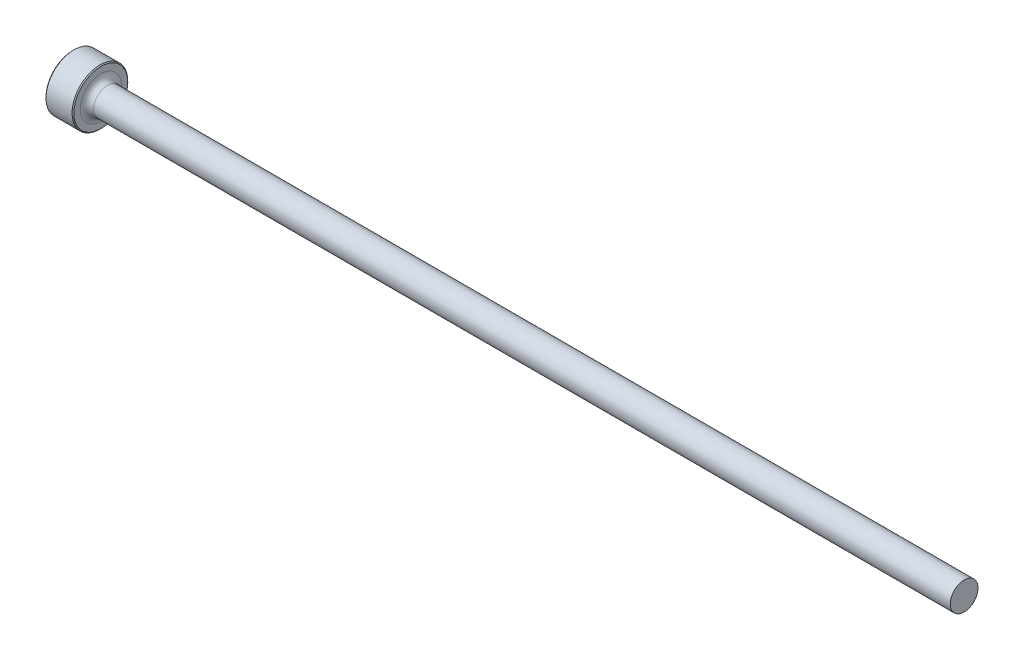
from build123d import *

# Parameters (mm, degrees)
CHAMFER1_SIZE = 0.1016


with BuildPart() as part:
    # Sketch1 → Revolve1 (revolve)
    with BuildSketch(Plane.XY):
        with BuildLine():
            Line((0, 0), (0, 3.175))
            Line((0, 3.175), (3.175, 3.175))
            Line((3.175, 3.175), (3.175, 2.34569))
            ThreePointArc((3.175, 2.34569), (3.398184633, 1.806874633), (3.937, 1.58369))
            Line((3.937, 1.58369), (101.6, 1.58369))
            Line((101.6, 1.58369), (101.6, 0))
            Line((101.6, 0), (0, 0))
        make_face()
    revolve(axis=Axis((101.6, 0, 0), (-1, 0, 0)))

    # Chamfer1
    chamfer1_edges = [part.edges().sort_by_distance(p)[0] for p in [
        (0, -3.175, 0),
        (3.175, -3.175, 0),
    ]]
    chamfer(chamfer1_edges, length=CHAMFER1_SIZE)


solid = part.part
